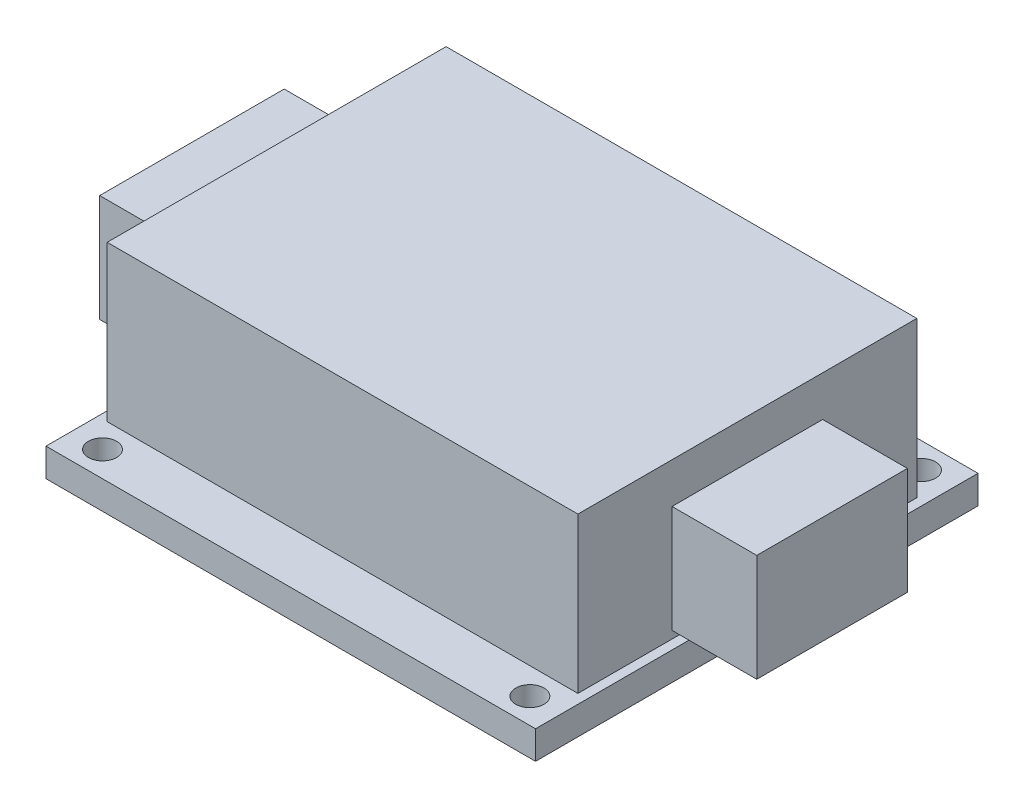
ISO-10303-21;
HEADER;
FILE_DESCRIPTION(('STEP AP214'),'2;1');
FILE_NAME('part.step','',(''),(''),'','','');
FILE_SCHEMA(('AUTOMOTIVE_DESIGN { 1 0 10303 214 1 1 1 1 }'));
ENDSEC;
DATA;
#1=APPLICATION_CONTEXT('core data for automotive mechanical design processes');
#2=APPLICATION_PROTOCOL_DEFINITION('international standard','automotive_design',2000,#1);
#3=PRODUCT_CONTEXT('',#1,'mechanical');
#4=PRODUCT('Part','Part','',(#3));
#5=PRODUCT_RELATED_PRODUCT_CATEGORY('part','',(#4));
#6=PRODUCT_DEFINITION_FORMATION('','',#4);
#7=PRODUCT_DEFINITION_CONTEXT('part definition',#1,'design');
#8=PRODUCT_DEFINITION('design','',#6,#7);
#9=PRODUCT_DEFINITION_SHAPE('','',#8);
#10=(LENGTH_UNIT() NAMED_UNIT(*) SI_UNIT(.MILLI.,.METRE.));
#11=(NAMED_UNIT(*) PLANE_ANGLE_UNIT() SI_UNIT($,.RADIAN.));
#12=(NAMED_UNIT(*) SI_UNIT($,.STERADIAN.) SOLID_ANGLE_UNIT());
#13=UNCERTAINTY_MEASURE_WITH_UNIT(LENGTH_MEASURE(1.E-05),#10,'distance_accuracy_value','');
#14=(GEOMETRIC_REPRESENTATION_CONTEXT(3) GLOBAL_UNCERTAINTY_ASSIGNED_CONTEXT((#13)) GLOBAL_UNIT_ASSIGNED_CONTEXT((#10,
#11,#12)) REPRESENTATION_CONTEXT('',''));
#15=CARTESIAN_POINT('',(0.,0.,0.));
#16=DIRECTION('',(0.,0.,1.));
#17=DIRECTION('',(1.,0.,0.));
#18=AXIS2_PLACEMENT_3D('',#15,#16,#17);
#19=CARTESIAN_POINT('',(-25.,19.5,-18.));
#20=DIRECTION('',(1.,0.,0.));
#21=DIRECTION('',(0.,0.,-1.));
#22=AXIS2_PLACEMENT_3D('',#19,#20,#21);
#23=PLANE('',#22);
#24=DIRECTION('',(0.,0.,1.));
#25=VECTOR('',#24,1.);
#26=CARTESIAN_POINT('',(-25.,3.,-18.));
#27=LINE('',#26,#25);
#28=CARTESIAN_POINT('',(-25.,3.,-18.));
#29=VERTEX_POINT('',#28);
#30=CARTESIAN_POINT('',(-25.,3.,18.));
#31=VERTEX_POINT('',#30);
#32=EDGE_CURVE('E225',#29,#31,#27,.T.);
#33=ORIENTED_EDGE('',*,*,#32,.T.);
#34=DIRECTION('',(0.,-1.,0.));
#35=VECTOR('',#34,1.);
#36=CARTESIAN_POINT('',(-25.,19.5,18.));
#37=LINE('',#36,#35);
#38=CARTESIAN_POINT('',(-25.,19.5,18.));
#39=VERTEX_POINT('',#38);
#40=EDGE_CURVE('E231',#39,#31,#37,.T.);
#41=ORIENTED_EDGE('',*,*,#40,.F.);
#42=DIRECTION('',(0.,0.,1.));
#43=VECTOR('',#42,1.);
#44=CARTESIAN_POINT('',(-25.,19.5,-18.));
#45=LINE('',#44,#43);
#46=CARTESIAN_POINT('',(-25.,19.5,-18.));
#47=VERTEX_POINT('',#46);
#48=EDGE_CURVE('E216',#47,#39,#45,.T.);
#49=ORIENTED_EDGE('',*,*,#48,.F.);
#50=DIRECTION('',(0.,-1.,0.));
#51=VECTOR('',#50,1.);
#52=CARTESIAN_POINT('',(-25.,19.5,-18.));
#53=LINE('',#52,#51);
#54=EDGE_CURVE('E233',#47,#29,#53,.T.);
#55=ORIENTED_EDGE('',*,*,#54,.T.);
#56=EDGE_LOOP('',(#33,#41,#49,#55));
#57=FACE_BOUND('',#56,.T.);
#58=DIRECTION('',(0.,1.,0.));
#59=VECTOR('',#58,1.);
#60=CARTESIAN_POINT('',(-25.,3.8,9.80000000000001));
#61=LINE('',#60,#59);
#62=CARTESIAN_POINT('',(-25.,3.8,9.80000000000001));
#63=VERTEX_POINT('',#62);
#64=CARTESIAN_POINT('',(-25.,15.2,9.8));
#65=VERTEX_POINT('',#64);
#66=EDGE_CURVE('E170',#63,#65,#61,.T.);
#67=ORIENTED_EDGE('',*,*,#66,.F.);
#68=DIRECTION('',(0.,0.,1.));
#69=VECTOR('',#68,1.);
#70=CARTESIAN_POINT('',(-25.,3.8,-9.8));
#71=LINE('',#70,#69);
#72=CARTESIAN_POINT('',(-25.,3.8,-9.8));
#73=VERTEX_POINT('',#72);
#74=EDGE_CURVE('E167',#73,#63,#71,.T.);
#75=ORIENTED_EDGE('',*,*,#74,.F.);
#76=DIRECTION('',(0.,-1.,0.));
#77=VECTOR('',#76,1.);
#78=CARTESIAN_POINT('',(-25.,3.8,-9.8));
#79=LINE('',#78,#77);
#80=CARTESIAN_POINT('',(-25.,15.2,-9.8));
#81=VERTEX_POINT('',#80);
#82=EDGE_CURVE('E57',#81,#73,#79,.T.);
#83=ORIENTED_EDGE('',*,*,#82,.F.);
#84=DIRECTION('',(0.,0.,-1.));
#85=VECTOR('',#84,1.);
#86=CARTESIAN_POINT('',(-25.,15.2,-9.8));
#87=LINE('',#86,#85);
#88=EDGE_CURVE('E52',#65,#81,#87,.T.);
#89=ORIENTED_EDGE('',*,*,#88,.F.);
#90=EDGE_LOOP('',(#67,#75,#83,#89));
#91=FACE_BOUND('',#90,.T.);
#92=ADVANCED_FACE('F37',(#57,#91),#23,.F.);
#93=CARTESIAN_POINT('',(25.,19.5,-18.));
#94=DIRECTION('',(-1.,0.,0.));
#95=DIRECTION('',(0.,0.,1.));
#96=AXIS2_PLACEMENT_3D('',#93,#94,#95);
#97=PLANE('',#96);
#98=DIRECTION('',(0.,0.,-1.));
#99=VECTOR('',#98,1.);
#100=CARTESIAN_POINT('',(25.,3.,-18.));
#101=LINE('',#100,#99);
#102=CARTESIAN_POINT('',(25.,3.,18.));
#103=VERTEX_POINT('',#102);
#104=CARTESIAN_POINT('',(25.,3.,-18.));
#105=VERTEX_POINT('',#104);
#106=EDGE_CURVE('E209',#103,#105,#101,.T.);
#107=ORIENTED_EDGE('',*,*,#106,.T.);
#108=DIRECTION('',(0.,-1.,0.));
#109=VECTOR('',#108,1.);
#110=CARTESIAN_POINT('',(25.,19.5,-18.));
#111=LINE('',#110,#109);
#112=CARTESIAN_POINT('',(25.,19.5,-18.));
#113=VERTEX_POINT('',#112);
#114=EDGE_CURVE('E236',#113,#105,#111,.T.);
#115=ORIENTED_EDGE('',*,*,#114,.F.);
#116=DIRECTION('',(0.,0.,-1.));
#117=VECTOR('',#116,1.);
#118=CARTESIAN_POINT('',(25.,19.5,-18.));
#119=LINE('',#118,#117);
#120=CARTESIAN_POINT('',(25.,19.5,18.));
#121=VERTEX_POINT('',#120);
#122=EDGE_CURVE('E210',#121,#113,#119,.T.);
#123=ORIENTED_EDGE('',*,*,#122,.F.);
#124=DIRECTION('',(0.,-1.,0.));
#125=VECTOR('',#124,1.);
#126=CARTESIAN_POINT('',(25.,19.5,18.));
#127=LINE('',#126,#125);
#128=EDGE_CURVE('E220',#121,#103,#127,.T.);
#129=ORIENTED_EDGE('',*,*,#128,.T.);
#130=EDGE_LOOP('',(#107,#115,#123,#129));
#131=FACE_BOUND('',#130,.T.);
#132=DIRECTION('',(0.,1.,0.));
#133=VECTOR('',#132,1.);
#134=CARTESIAN_POINT('',(25.,15.2,-8.));
#135=LINE('',#134,#133);
#136=CARTESIAN_POINT('',(25.,3.8,-8.));
#137=VERTEX_POINT('',#136);
#138=CARTESIAN_POINT('',(25.,15.2,-8.));
#139=VERTEX_POINT('',#138);
#140=EDGE_CURVE('E171',#137,#139,#135,.T.);
#141=ORIENTED_EDGE('',*,*,#140,.F.);
#142=DIRECTION('',(0.,0.,-1.));
#143=VECTOR('',#142,1.);
#144=CARTESIAN_POINT('',(25.,3.8,8.));
#145=LINE('',#144,#143);
#146=CARTESIAN_POINT('',(25.,3.8,8.));
#147=VERTEX_POINT('',#146);
#148=EDGE_CURVE('E184',#147,#137,#145,.T.);
#149=ORIENTED_EDGE('',*,*,#148,.F.);
#150=DIRECTION('',(0.,-1.,0.));
#151=VECTOR('',#150,1.);
#152=CARTESIAN_POINT('',(25.,15.2,8.));
#153=LINE('',#152,#151);
#154=CARTESIAN_POINT('',(25.,15.2,8.));
#155=VERTEX_POINT('',#154);
#156=EDGE_CURVE('E193',#155,#147,#153,.T.);
#157=ORIENTED_EDGE('',*,*,#156,.F.);
#158=DIRECTION('',(0.,0.,1.));
#159=VECTOR('',#158,1.);
#160=CARTESIAN_POINT('',(25.,15.2,8.));
#161=LINE('',#160,#159);
#162=EDGE_CURVE('E174',#139,#155,#161,.T.);
#163=ORIENTED_EDGE('',*,*,#162,.F.);
#164=EDGE_LOOP('',(#141,#149,#157,#163));
#165=FACE_BOUND('',#164,.T.);
#166=ADVANCED_FACE('F316',(#131,#165),#97,.F.);
#167=CARTESIAN_POINT('',(0.,3.,0.));
#168=DIRECTION('',(0.,1.,0.));
#169=DIRECTION('',(0.,0.,1.));
#170=AXIS2_PLACEMENT_3D('',#167,#168,#169);
#171=PLANE('',#170);
#172=CARTESIAN_POINT('',(22.7,3.,20.8));
#173=DIRECTION('',(0.,1.,0.));
#174=DIRECTION('',(0.,0.,-1.));
#175=AXIS2_PLACEMENT_3D('',#172,#173,#174);
#176=CIRCLE('',#175,1.5);
#177=CARTESIAN_POINT('',(22.7,3.,19.3));
#178=VERTEX_POINT('',#177);
#179=EDGE_CURVE('E245',#178,#178,#176,.T.);
#180=ORIENTED_EDGE('',*,*,#179,.F.);
#181=EDGE_LOOP('',(#180));
#182=FACE_BOUND('',#181,.T.);
#183=CARTESIAN_POINT('',(-22.7,3.,-20.8));
#184=DIRECTION('',(0.,1.,0.));
#185=DIRECTION('',(0.,0.,1.));
#186=AXIS2_PLACEMENT_3D('',#183,#184,#185);
#187=CIRCLE('',#186,1.5);
#188=CARTESIAN_POINT('',(-22.7,3.,-19.3));
#189=VERTEX_POINT('',#188);
#190=EDGE_CURVE('E257',#189,#189,#187,.T.);
#191=ORIENTED_EDGE('',*,*,#190,.F.);
#192=EDGE_LOOP('',(#191));
#193=FACE_BOUND('',#192,.T.);
#194=DIRECTION('',(0.,0.,-1.));
#195=VECTOR('',#194,1.);
#196=CARTESIAN_POINT('',(26.,3.,-23.5));
#197=LINE('',#196,#195);
#198=CARTESIAN_POINT('',(26.,3.,23.5));
#199=VERTEX_POINT('',#198);
#200=CARTESIAN_POINT('',(26.,3.,-23.5));
#201=VERTEX_POINT('',#200);
#202=EDGE_CURVE('E263',#199,#201,#197,.T.);
#203=ORIENTED_EDGE('',*,*,#202,.T.);
#204=DIRECTION('',(-1.,0.,0.));
#205=VECTOR('',#204,1.);
#206=CARTESIAN_POINT('',(-26.,3.,-23.5));
#207=LINE('',#206,#205);
#208=CARTESIAN_POINT('',(-26.,3.,-23.5));
#209=VERTEX_POINT('',#208);
#210=EDGE_CURVE('E266',#201,#209,#207,.T.);
#211=ORIENTED_EDGE('',*,*,#210,.T.);
#212=DIRECTION('',(0.,0.,1.));
#213=VECTOR('',#212,1.);
#214=CARTESIAN_POINT('',(-26.,3.,-23.5));
#215=LINE('',#214,#213);
#216=CARTESIAN_POINT('',(-26.,3.,23.5));
#217=VERTEX_POINT('',#216);
#218=EDGE_CURVE('E269',#209,#217,#215,.T.);
#219=ORIENTED_EDGE('',*,*,#218,.T.);
#220=DIRECTION('',(1.,0.,0.));
#221=VECTOR('',#220,1.);
#222=CARTESIAN_POINT('',(-26.,3.,23.5));
#223=LINE('',#222,#221);
#224=EDGE_CURVE('E271',#217,#199,#223,.T.);
#225=ORIENTED_EDGE('',*,*,#224,.T.);
#226=EDGE_LOOP('',(#203,#211,#219,#225));
#227=FACE_BOUND('',#226,.T.);
#228=CARTESIAN_POINT('',(-22.7,3.,20.8));
#229=DIRECTION('',(0.,1.,0.));
#230=DIRECTION('',(0.,0.,1.));
#231=AXIS2_PLACEMENT_3D('',#228,#229,#230);
#232=CIRCLE('',#231,1.5);
#233=CARTESIAN_POINT('',(-22.7,3.,22.3));
#234=VERTEX_POINT('',#233);
#235=EDGE_CURVE('E251',#234,#234,#232,.T.);
#236=ORIENTED_EDGE('',*,*,#235,.F.);
#237=EDGE_LOOP('',(#236));
#238=FACE_BOUND('',#237,.T.);
#239=CARTESIAN_POINT('',(22.7,3.,-20.8));
#240=DIRECTION('',(0.,1.,0.));
#241=DIRECTION('',(0.,0.,-1.));
#242=AXIS2_PLACEMENT_3D('',#239,#240,#241);
#243=CIRCLE('',#242,1.5);
#244=CARTESIAN_POINT('',(22.7,3.,-22.3));
#245=VERTEX_POINT('',#244);
#246=EDGE_CURVE('E239',#245,#245,#243,.T.);
#247=ORIENTED_EDGE('',*,*,#246,.F.);
#248=EDGE_LOOP('',(#247));
#249=FACE_BOUND('',#248,.T.);
#250=DIRECTION('',(-1.,0.,0.));
#251=VECTOR('',#250,1.);
#252=CARTESIAN_POINT('',(-25.,3.,-18.));
#253=LINE('',#252,#251);
#254=EDGE_CURVE('E223',#105,#29,#253,.T.);
#255=ORIENTED_EDGE('',*,*,#254,.F.);
#256=ORIENTED_EDGE('',*,*,#106,.F.);
#257=DIRECTION('',(1.,0.,0.));
#258=VECTOR('',#257,1.);
#259=CARTESIAN_POINT('',(-25.,3.,18.));
#260=LINE('',#259,#258);
#261=EDGE_CURVE('E214',#31,#103,#260,.T.);
#262=ORIENTED_EDGE('',*,*,#261,.F.);
#263=ORIENTED_EDGE('',*,*,#32,.F.);
#264=EDGE_LOOP('',(#255,#256,#262,#263));
#265=FACE_BOUND('',#264,.T.);
#266=ADVANCED_FACE('F306',(#182,#193,#227,#238,#249,#265),#171,.T.);
#267=CARTESIAN_POINT('',(0.,0.,0.));
#268=DIRECTION('',(0.,1.,0.));
#269=DIRECTION('',(0.,0.,1.));
#270=AXIS2_PLACEMENT_3D('',#267,#268,#269);
#271=PLANE('',#270);
#272=DIRECTION('',(0.,0.,-1.));
#273=VECTOR('',#272,1.);
#274=CARTESIAN_POINT('',(26.,0.,-23.5));
#275=LINE('',#274,#273);
#276=CARTESIAN_POINT('',(26.,0.,23.5));
#277=VERTEX_POINT('',#276);
#278=CARTESIAN_POINT('',(26.,0.,-23.5));
#279=VERTEX_POINT('',#278);
#280=EDGE_CURVE('E260',#277,#279,#275,.T.);
#281=ORIENTED_EDGE('',*,*,#280,.F.);
#282=DIRECTION('',(1.,0.,0.));
#283=VECTOR('',#282,1.);
#284=CARTESIAN_POINT('',(-26.,0.,23.5));
#285=LINE('',#284,#283);
#286=CARTESIAN_POINT('',(-26.,0.,23.5));
#287=VERTEX_POINT('',#286);
#288=EDGE_CURVE('E267',#287,#277,#285,.T.);
#289=ORIENTED_EDGE('',*,*,#288,.F.);
#290=DIRECTION('',(0.,0.,1.));
#291=VECTOR('',#290,1.);
#292=CARTESIAN_POINT('',(-26.,0.,-23.5));
#293=LINE('',#292,#291);
#294=CARTESIAN_POINT('',(-26.,0.,-23.5));
#295=VERTEX_POINT('',#294);
#296=EDGE_CURVE('E278',#295,#287,#293,.T.);
#297=ORIENTED_EDGE('',*,*,#296,.F.);
#298=DIRECTION('',(-1.,0.,0.));
#299=VECTOR('',#298,1.);
#300=CARTESIAN_POINT('',(-26.,0.,-23.5));
#301=LINE('',#300,#299);
#302=EDGE_CURVE('E276',#279,#295,#301,.T.);
#303=ORIENTED_EDGE('',*,*,#302,.F.);
#304=EDGE_LOOP('',(#281,#289,#297,#303));
#305=FACE_BOUND('',#304,.T.);
#306=CARTESIAN_POINT('',(-22.7,0.,-20.8));
#307=DIRECTION('',(0.,1.,0.));
#308=DIRECTION('',(0.,0.,1.));
#309=AXIS2_PLACEMENT_3D('',#306,#307,#308);
#310=CIRCLE('',#309,1.5);
#311=CARTESIAN_POINT('',(-22.7,0.,-19.3));
#312=VERTEX_POINT('',#311);
#313=EDGE_CURVE('E254',#312,#312,#310,.T.);
#314=ORIENTED_EDGE('',*,*,#313,.T.);
#315=EDGE_LOOP('',(#314));
#316=FACE_BOUND('',#315,.T.);
#317=CARTESIAN_POINT('',(-22.7,0.,20.8));
#318=DIRECTION('',(0.,1.,0.));
#319=DIRECTION('',(0.,0.,1.));
#320=AXIS2_PLACEMENT_3D('',#317,#318,#319);
#321=CIRCLE('',#320,1.5);
#322=CARTESIAN_POINT('',(-22.7,0.,22.3));
#323=VERTEX_POINT('',#322);
#324=EDGE_CURVE('E248',#323,#323,#321,.T.);
#325=ORIENTED_EDGE('',*,*,#324,.T.);
#326=EDGE_LOOP('',(#325));
#327=FACE_BOUND('',#326,.T.);
#328=CARTESIAN_POINT('',(22.7,0.,20.8));
#329=DIRECTION('',(0.,1.,0.));
#330=DIRECTION('',(0.,0.,-1.));
#331=AXIS2_PLACEMENT_3D('',#328,#329,#330);
#332=CIRCLE('',#331,1.5);
#333=CARTESIAN_POINT('',(22.7,0.,19.3));
#334=VERTEX_POINT('',#333);
#335=EDGE_CURVE('E242',#334,#334,#332,.T.);
#336=ORIENTED_EDGE('',*,*,#335,.T.);
#337=EDGE_LOOP('',(#336));
#338=FACE_BOUND('',#337,.T.);
#339=CARTESIAN_POINT('',(22.7,0.,-20.8));
#340=DIRECTION('',(0.,1.,0.));
#341=DIRECTION('',(0.,0.,-1.));
#342=AXIS2_PLACEMENT_3D('',#339,#340,#341);
#343=CIRCLE('',#342,1.5);
#344=CARTESIAN_POINT('',(22.7,0.,-22.3));
#345=VERTEX_POINT('',#344);
#346=EDGE_CURVE('E238',#345,#345,#343,.T.);
#347=ORIENTED_EDGE('',*,*,#346,.T.);
#348=EDGE_LOOP('',(#347));
#349=FACE_BOUND('',#348,.T.);
#350=ADVANCED_FACE('F296',(#305,#316,#327,#338,#349),#271,.F.);
#351=CARTESIAN_POINT('',(26.,3.,-23.5));
#352=DIRECTION('',(-1.,0.,0.));
#353=DIRECTION('',(0.,0.,1.));
#354=AXIS2_PLACEMENT_3D('',#351,#352,#353);
#355=PLANE('',#354);
#356=ORIENTED_EDGE('',*,*,#280,.T.);
#357=DIRECTION('',(0.,-1.,0.));
#358=VECTOR('',#357,1.);
#359=CARTESIAN_POINT('',(26.,3.,-23.5));
#360=LINE('',#359,#358);
#361=EDGE_CURVE('E11',#201,#279,#360,.T.);
#362=ORIENTED_EDGE('',*,*,#361,.F.);
#363=ORIENTED_EDGE('',*,*,#202,.F.);
#364=DIRECTION('',(0.,-1.,0.));
#365=VECTOR('',#364,1.);
#366=CARTESIAN_POINT('',(26.,3.,23.5));
#367=LINE('',#366,#365);
#368=EDGE_CURVE('E273',#199,#277,#367,.T.);
#369=ORIENTED_EDGE('',*,*,#368,.T.);
#370=EDGE_LOOP('',(#356,#362,#363,#369));
#371=FACE_BOUND('',#370,.T.);
#372=ADVANCED_FACE('F39',(#371),#355,.F.);
#373=CARTESIAN_POINT('',(-26.,3.,-23.5));
#374=DIRECTION('',(0.,0.,1.));
#375=DIRECTION('',(1.,0.,0.));
#376=AXIS2_PLACEMENT_3D('',#373,#374,#375);
#377=PLANE('',#376);
#378=ORIENTED_EDGE('',*,*,#302,.T.);
#379=DIRECTION('',(0.,-1.,0.));
#380=VECTOR('',#379,1.);
#381=CARTESIAN_POINT('',(-26.,3.,-23.5));
#382=LINE('',#381,#380);
#383=EDGE_CURVE('E45',#209,#295,#382,.T.);
#384=ORIENTED_EDGE('',*,*,#383,.F.);
#385=ORIENTED_EDGE('',*,*,#210,.F.);
#386=ORIENTED_EDGE('',*,*,#361,.T.);
#387=EDGE_LOOP('',(#378,#384,#385,#386));
#388=FACE_BOUND('',#387,.T.);
#389=ADVANCED_FACE('F308',(#388),#377,.F.);
#390=CARTESIAN_POINT('',(-26.,3.,-23.5));
#391=DIRECTION('',(1.,0.,0.));
#392=DIRECTION('',(0.,0.,-1.));
#393=AXIS2_PLACEMENT_3D('',#390,#391,#392);
#394=PLANE('',#393);
#395=ORIENTED_EDGE('',*,*,#296,.T.);
#396=DIRECTION('',(0.,-1.,0.));
#397=VECTOR('',#396,1.);
#398=CARTESIAN_POINT('',(-26.,3.,23.5));
#399=LINE('',#398,#397);
#400=EDGE_CURVE('E283',#217,#287,#399,.T.);
#401=ORIENTED_EDGE('',*,*,#400,.F.);
#402=ORIENTED_EDGE('',*,*,#218,.F.);
#403=ORIENTED_EDGE('',*,*,#383,.T.);
#404=EDGE_LOOP('',(#395,#401,#402,#403));
#405=FACE_BOUND('',#404,.T.);
#406=ADVANCED_FACE('F290',(#405),#394,.F.);
#407=CARTESIAN_POINT('',(-26.,3.,23.5));
#408=DIRECTION('',(0.,0.,-1.));
#409=DIRECTION('',(-1.,0.,0.));
#410=AXIS2_PLACEMENT_3D('',#407,#408,#409);
#411=PLANE('',#410);
#412=ORIENTED_EDGE('',*,*,#288,.T.);
#413=ORIENTED_EDGE('',*,*,#368,.F.);
#414=ORIENTED_EDGE('',*,*,#224,.F.);
#415=ORIENTED_EDGE('',*,*,#400,.T.);
#416=EDGE_LOOP('',(#412,#413,#414,#415));
#417=FACE_BOUND('',#416,.T.);
#418=ADVANCED_FACE('F300',(#417),#411,.F.);
#419=CARTESIAN_POINT('',(-22.7,3.,-20.8));
#420=DIRECTION('',(0.,-1.,0.));
#421=DIRECTION('',(0.,0.,-1.));
#422=AXIS2_PLACEMENT_3D('',#419,#420,#421);
#423=CYLINDRICAL_SURFACE('',#422,1.5);
#424=ORIENTED_EDGE('',*,*,#190,.T.);
#425=EDGE_LOOP('',(#424));
#426=FACE_BOUND('',#425,.T.);
#427=ORIENTED_EDGE('',*,*,#313,.F.);
#428=EDGE_LOOP('',(#427));
#429=FACE_BOUND('',#428,.T.);
#430=ADVANCED_FACE('F343',(#426,#429),#423,.F.);
#431=CARTESIAN_POINT('',(-22.7,3.,20.8));
#432=DIRECTION('',(0.,-1.,0.));
#433=DIRECTION('',(0.,0.,-1.));
#434=AXIS2_PLACEMENT_3D('',#431,#432,#433);
#435=CYLINDRICAL_SURFACE('',#434,1.5);
#436=ORIENTED_EDGE('',*,*,#235,.T.);
#437=EDGE_LOOP('',(#436));
#438=FACE_BOUND('',#437,.T.);
#439=ORIENTED_EDGE('',*,*,#324,.F.);
#440=EDGE_LOOP('',(#439));
#441=FACE_BOUND('',#440,.T.);
#442=ADVANCED_FACE('F339',(#438,#441),#435,.F.);
#443=CARTESIAN_POINT('',(22.7,3.,20.8));
#444=DIRECTION('',(0.,-1.,0.));
#445=DIRECTION('',(0.,0.,-1.));
#446=AXIS2_PLACEMENT_3D('',#443,#444,#445);
#447=CYLINDRICAL_SURFACE('',#446,1.5);
#448=ORIENTED_EDGE('',*,*,#179,.T.);
#449=EDGE_LOOP('',(#448));
#450=FACE_BOUND('',#449,.T.);
#451=ORIENTED_EDGE('',*,*,#335,.F.);
#452=EDGE_LOOP('',(#451));
#453=FACE_BOUND('',#452,.T.);
#454=ADVANCED_FACE('F335',(#450,#453),#447,.F.);
#455=CARTESIAN_POINT('',(22.7,3.,-20.8));
#456=DIRECTION('',(0.,-1.,0.));
#457=DIRECTION('',(0.,0.,-1.));
#458=AXIS2_PLACEMENT_3D('',#455,#456,#457);
#459=CYLINDRICAL_SURFACE('',#458,1.5);
#460=ORIENTED_EDGE('',*,*,#246,.T.);
#461=EDGE_LOOP('',(#460));
#462=FACE_BOUND('',#461,.T.);
#463=ORIENTED_EDGE('',*,*,#346,.F.);
#464=EDGE_LOOP('',(#463));
#465=FACE_BOUND('',#464,.T.);
#466=ADVANCED_FACE('F330',(#462,#465),#459,.F.);
#467=CARTESIAN_POINT('',(-25.,19.5,-18.));
#468=DIRECTION('',(0.,0.,1.));
#469=DIRECTION('',(1.,0.,0.));
#470=AXIS2_PLACEMENT_3D('',#467,#468,#469);
#471=PLANE('',#470);
#472=ORIENTED_EDGE('',*,*,#254,.T.);
#473=ORIENTED_EDGE('',*,*,#54,.F.);
#474=DIRECTION('',(-1.,0.,0.));
#475=VECTOR('',#474,1.);
#476=CARTESIAN_POINT('',(-25.,19.5,-18.));
#477=LINE('',#476,#475);
#478=EDGE_CURVE('E213',#113,#47,#477,.T.);
#479=ORIENTED_EDGE('',*,*,#478,.F.);
#480=ORIENTED_EDGE('',*,*,#114,.T.);
#481=EDGE_LOOP('',(#472,#473,#479,#480));
#482=FACE_BOUND('',#481,.T.);
#483=ADVANCED_FACE('F328',(#482),#471,.F.);
#484=CARTESIAN_POINT('',(-25.,19.5,18.));
#485=DIRECTION('',(0.,0.,-1.));
#486=DIRECTION('',(-1.,0.,0.));
#487=AXIS2_PLACEMENT_3D('',#484,#485,#486);
#488=PLANE('',#487);
#489=ORIENTED_EDGE('',*,*,#261,.T.);
#490=ORIENTED_EDGE('',*,*,#128,.F.);
#491=DIRECTION('',(1.,0.,0.));
#492=VECTOR('',#491,1.);
#493=CARTESIAN_POINT('',(-25.,19.5,18.));
#494=LINE('',#493,#492);
#495=EDGE_CURVE('E218',#39,#121,#494,.T.);
#496=ORIENTED_EDGE('',*,*,#495,.F.);
#497=ORIENTED_EDGE('',*,*,#40,.T.);
#498=EDGE_LOOP('',(#489,#490,#496,#497));
#499=FACE_BOUND('',#498,.T.);
#500=ADVANCED_FACE('F326',(#499),#488,.F.);
#501=CARTESIAN_POINT('',(0.,19.5,0.));
#502=DIRECTION('',(0.,1.,0.));
#503=DIRECTION('',(0.,0.,1.));
#504=AXIS2_PLACEMENT_3D('',#501,#502,#503);
#505=PLANE('',#504);
#506=ORIENTED_EDGE('',*,*,#122,.T.);
#507=ORIENTED_EDGE('',*,*,#478,.T.);
#508=ORIENTED_EDGE('',*,*,#48,.T.);
#509=ORIENTED_EDGE('',*,*,#495,.T.);
#510=EDGE_LOOP('',(#506,#507,#508,#509));
#511=FACE_BOUND('',#510,.T.);
#512=ADVANCED_FACE('F385',(#511),#505,.T.);
#513=CARTESIAN_POINT('',(34.,15.2,-8.));
#514=DIRECTION('',(0.,0.,1.));
#515=DIRECTION('',(0.,-1.,0.));
#516=AXIS2_PLACEMENT_3D('',#513,#514,#515);
#517=PLANE('',#516);
#518=ORIENTED_EDGE('',*,*,#140,.T.);
#519=DIRECTION('',(-1.,0.,0.));
#520=VECTOR('',#519,1.);
#521=CARTESIAN_POINT('',(34.,15.2,-8.));
#522=LINE('',#521,#520);
#523=CARTESIAN_POINT('',(34.,15.2,-8.));
#524=VERTEX_POINT('',#523);
#525=EDGE_CURVE('E206',#524,#139,#522,.T.);
#526=ORIENTED_EDGE('',*,*,#525,.F.);
#527=DIRECTION('',(0.,1.,0.));
#528=VECTOR('',#527,1.);
#529=CARTESIAN_POINT('',(34.,15.2,-8.));
#530=LINE('',#529,#528);
#531=CARTESIAN_POINT('',(34.,3.8,-8.));
#532=VERTEX_POINT('',#531);
#533=EDGE_CURVE('E180',#532,#524,#530,.T.);
#534=ORIENTED_EDGE('',*,*,#533,.F.);
#535=DIRECTION('',(-1.,0.,0.));
#536=VECTOR('',#535,1.);
#537=CARTESIAN_POINT('',(34.,3.8,-8.));
#538=LINE('',#537,#536);
#539=EDGE_CURVE('E189',#532,#137,#538,.T.);
#540=ORIENTED_EDGE('',*,*,#539,.T.);
#541=EDGE_LOOP('',(#518,#526,#534,#540));
#542=FACE_BOUND('',#541,.T.);
#543=ADVANCED_FACE('F392',(#542),#517,.F.);
#544=CARTESIAN_POINT('',(34.,15.2,8.));
#545=DIRECTION('',(0.,-1.,0.));
#546=DIRECTION('',(0.,0.,-1.));
#547=AXIS2_PLACEMENT_3D('',#544,#545,#546);
#548=PLANE('',#547);
#549=ORIENTED_EDGE('',*,*,#162,.T.);
#550=DIRECTION('',(-1.,0.,0.));
#551=VECTOR('',#550,1.);
#552=CARTESIAN_POINT('',(34.,15.2,8.));
#553=LINE('',#552,#551);
#554=CARTESIAN_POINT('',(34.,15.2,8.));
#555=VERTEX_POINT('',#554);
#556=EDGE_CURVE('E203',#555,#155,#553,.T.);
#557=ORIENTED_EDGE('',*,*,#556,.F.);
#558=DIRECTION('',(0.,0.,1.));
#559=VECTOR('',#558,1.);
#560=CARTESIAN_POINT('',(34.,15.2,8.));
#561=LINE('',#560,#559);
#562=EDGE_CURVE('E183',#524,#555,#561,.T.);
#563=ORIENTED_EDGE('',*,*,#562,.F.);
#564=ORIENTED_EDGE('',*,*,#525,.T.);
#565=EDGE_LOOP('',(#549,#557,#563,#564));
#566=FACE_BOUND('',#565,.T.);
#567=ADVANCED_FACE('F400',(#566),#548,.F.);
#568=CARTESIAN_POINT('',(34.,15.2,8.));
#569=DIRECTION('',(0.,0.,-1.));
#570=DIRECTION('',(0.,1.,0.));
#571=AXIS2_PLACEMENT_3D('',#568,#569,#570);
#572=PLANE('',#571);
#573=ORIENTED_EDGE('',*,*,#156,.T.);
#574=DIRECTION('',(-1.,0.,0.));
#575=VECTOR('',#574,1.);
#576=CARTESIAN_POINT('',(34.,3.8,8.));
#577=LINE('',#576,#575);
#578=CARTESIAN_POINT('',(34.,3.8,8.));
#579=VERTEX_POINT('',#578);
#580=EDGE_CURVE('E200',#579,#147,#577,.T.);
#581=ORIENTED_EDGE('',*,*,#580,.F.);
#582=DIRECTION('',(0.,-1.,0.));
#583=VECTOR('',#582,1.);
#584=CARTESIAN_POINT('',(34.,15.2,8.));
#585=LINE('',#584,#583);
#586=EDGE_CURVE('E186',#555,#579,#585,.T.);
#587=ORIENTED_EDGE('',*,*,#586,.F.);
#588=ORIENTED_EDGE('',*,*,#556,.T.);
#589=EDGE_LOOP('',(#573,#581,#587,#588));
#590=FACE_BOUND('',#589,.T.);
#591=ADVANCED_FACE('F408',(#590),#572,.F.);
#592=CARTESIAN_POINT('',(34.,3.8,8.));
#593=DIRECTION('',(0.,1.,0.));
#594=DIRECTION('',(0.,0.,1.));
#595=AXIS2_PLACEMENT_3D('',#592,#593,#594);
#596=PLANE('',#595);
#597=ORIENTED_EDGE('',*,*,#148,.T.);
#598=ORIENTED_EDGE('',*,*,#539,.F.);
#599=DIRECTION('',(0.,0.,-1.));
#600=VECTOR('',#599,1.);
#601=CARTESIAN_POINT('',(34.,3.8,8.));
#602=LINE('',#601,#600);
#603=EDGE_CURVE('E188',#579,#532,#602,.T.);
#604=ORIENTED_EDGE('',*,*,#603,.F.);
#605=ORIENTED_EDGE('',*,*,#580,.T.);
#606=EDGE_LOOP('',(#597,#598,#604,#605));
#607=FACE_BOUND('',#606,.T.);
#608=ADVANCED_FACE('F416',(#607),#596,.F.);
#609=CARTESIAN_POINT('',(34.,0.,0.));
#610=DIRECTION('',(1.,0.,0.));
#611=DIRECTION('',(0.,0.,-1.));
#612=AXIS2_PLACEMENT_3D('',#609,#610,#611);
#613=PLANE('',#612);
#614=ORIENTED_EDGE('',*,*,#533,.T.);
#615=ORIENTED_EDGE('',*,*,#562,.T.);
#616=ORIENTED_EDGE('',*,*,#586,.T.);
#617=ORIENTED_EDGE('',*,*,#603,.T.);
#618=EDGE_LOOP('',(#614,#615,#616,#617));
#619=FACE_BOUND('',#618,.T.);
#620=ADVANCED_FACE('F424',(#619),#613,.T.);
#621=CARTESIAN_POINT('',(-34.,3.8,9.80000000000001));
#622=DIRECTION('',(0.,0.,-1.));
#623=DIRECTION('',(-1.,0.,0.));
#624=AXIS2_PLACEMENT_3D('',#621,#622,#623);
#625=PLANE('',#624);
#626=ORIENTED_EDGE('',*,*,#66,.T.);
#627=DIRECTION('',(1.,0.,0.));
#628=VECTOR('',#627,1.);
#629=CARTESIAN_POINT('',(-34.,15.2,9.80000000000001));
#630=LINE('',#629,#628);
#631=CARTESIAN_POINT('',(-34.,15.2,9.80000000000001));
#632=VERTEX_POINT('',#631);
#633=EDGE_CURVE('E151',#632,#65,#630,.T.);
#634=ORIENTED_EDGE('',*,*,#633,.F.);
#635=DIRECTION('',(0.,1.,0.));
#636=VECTOR('',#635,1.);
#637=CARTESIAN_POINT('',(-34.,3.8,9.80000000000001));
#638=LINE('',#637,#636);
#639=CARTESIAN_POINT('',(-34.,3.8,9.80000000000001));
#640=VERTEX_POINT('',#639);
#641=EDGE_CURVE('E158',#640,#632,#638,.T.);
#642=ORIENTED_EDGE('',*,*,#641,.F.);
#643=DIRECTION('',(1.,0.,0.));
#644=VECTOR('',#643,1.);
#645=CARTESIAN_POINT('',(-34.,3.8,9.80000000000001));
#646=LINE('',#645,#644);
#647=EDGE_CURVE('E541',#640,#63,#646,.T.);
#648=ORIENTED_EDGE('',*,*,#647,.T.);
#649=EDGE_LOOP('',(#626,#634,#642,#648));
#650=FACE_BOUND('',#649,.T.);
#651=ADVANCED_FACE('F169',(#650),#625,.F.);
#652=CARTESIAN_POINT('',(-34.,15.2,-9.8));
#653=DIRECTION('',(0.,-1.,0.));
#654=DIRECTION('',(0.,0.,-1.));
#655=AXIS2_PLACEMENT_3D('',#652,#653,#654);
#656=PLANE('',#655);
#657=ORIENTED_EDGE('',*,*,#88,.T.);
#658=DIRECTION('',(1.,0.,0.));
#659=VECTOR('',#658,1.);
#660=CARTESIAN_POINT('',(-34.,15.2,-9.8));
#661=LINE('',#660,#659);
#662=CARTESIAN_POINT('',(-34.,15.2,-9.8));
#663=VERTEX_POINT('',#662);
#664=EDGE_CURVE('E154',#663,#81,#661,.T.);
#665=ORIENTED_EDGE('',*,*,#664,.F.);
#666=DIRECTION('',(0.,0.,-1.));
#667=VECTOR('',#666,1.);
#668=CARTESIAN_POINT('',(-34.,15.2,-9.8));
#669=LINE('',#668,#667);
#670=EDGE_CURVE('E147',#632,#663,#669,.T.);
#671=ORIENTED_EDGE('',*,*,#670,.F.);
#672=ORIENTED_EDGE('',*,*,#633,.T.);
#673=EDGE_LOOP('',(#657,#665,#671,#672));
#674=FACE_BOUND('',#673,.T.);
#675=ADVANCED_FACE('F149',(#674),#656,.F.);
#676=CARTESIAN_POINT('',(-34.,3.8,-9.8));
#677=DIRECTION('',(0.,0.,1.));
#678=DIRECTION('',(1.,0.,0.));
#679=AXIS2_PLACEMENT_3D('',#676,#677,#678);
#680=PLANE('',#679);
#681=ORIENTED_EDGE('',*,*,#82,.T.);
#682=DIRECTION('',(1.,0.,0.));
#683=VECTOR('',#682,1.);
#684=CARTESIAN_POINT('',(-34.,3.8,-9.8));
#685=LINE('',#684,#683);
#686=CARTESIAN_POINT('',(-34.,3.8,-9.8));
#687=VERTEX_POINT('',#686);
#688=EDGE_CURVE('E176',#687,#73,#685,.T.);
#689=ORIENTED_EDGE('',*,*,#688,.F.);
#690=DIRECTION('',(0.,-1.,0.));
#691=VECTOR('',#690,1.);
#692=CARTESIAN_POINT('',(-34.,3.8,-9.8));
#693=LINE('',#692,#691);
#694=EDGE_CURVE('E157',#663,#687,#693,.T.);
#695=ORIENTED_EDGE('',*,*,#694,.F.);
#696=ORIENTED_EDGE('',*,*,#664,.T.);
#697=EDGE_LOOP('',(#681,#689,#695,#696));
#698=FACE_BOUND('',#697,.T.);
#699=ADVANCED_FACE('F445',(#698),#680,.F.);
#700=CARTESIAN_POINT('',(-34.,3.8,-9.8));
#701=DIRECTION('',(0.,1.,0.));
#702=DIRECTION('',(0.,0.,1.));
#703=AXIS2_PLACEMENT_3D('',#700,#701,#702);
#704=PLANE('',#703);
#705=ORIENTED_EDGE('',*,*,#74,.T.);
#706=ORIENTED_EDGE('',*,*,#647,.F.);
#707=DIRECTION('',(0.,0.,1.));
#708=VECTOR('',#707,1.);
#709=CARTESIAN_POINT('',(-34.,3.8,-9.8));
#710=LINE('',#709,#708);
#711=EDGE_CURVE('E163',#687,#640,#710,.T.);
#712=ORIENTED_EDGE('',*,*,#711,.F.);
#713=ORIENTED_EDGE('',*,*,#688,.T.);
#714=EDGE_LOOP('',(#705,#706,#712,#713));
#715=FACE_BOUND('',#714,.T.);
#716=ADVANCED_FACE('F452',(#715),#704,.F.);
#717=CARTESIAN_POINT('',(-34.,0.,0.));
#718=DIRECTION('',(1.,0.,0.));
#719=DIRECTION('',(0.,0.,-1.));
#720=AXIS2_PLACEMENT_3D('',#717,#718,#719);
#721=PLANE('',#720);
#722=ORIENTED_EDGE('',*,*,#641,.T.);
#723=ORIENTED_EDGE('',*,*,#670,.T.);
#724=ORIENTED_EDGE('',*,*,#694,.T.);
#725=ORIENTED_EDGE('',*,*,#711,.T.);
#726=EDGE_LOOP('',(#722,#723,#724,#725));
#727=FACE_BOUND('',#726,.T.);
#728=ADVANCED_FACE('F161',(#727),#721,.F.);
#729=CLOSED_SHELL('',(#92,#166,#266,#350,#372,#389,#406,#418,#430,#442,#454,#466,#483,#500,#512,
#543,#567,#591,#608,#620,#651,#675,#699,#716,#728));
#730=MANIFOLD_SOLID_BREP('B2',#729);
#731=ADVANCED_BREP_SHAPE_REPRESENTATION('',(#18,#730),#14);
#732=SHAPE_DEFINITION_REPRESENTATION(#9,#731);
ENDSEC;
END-ISO-10303-21;
